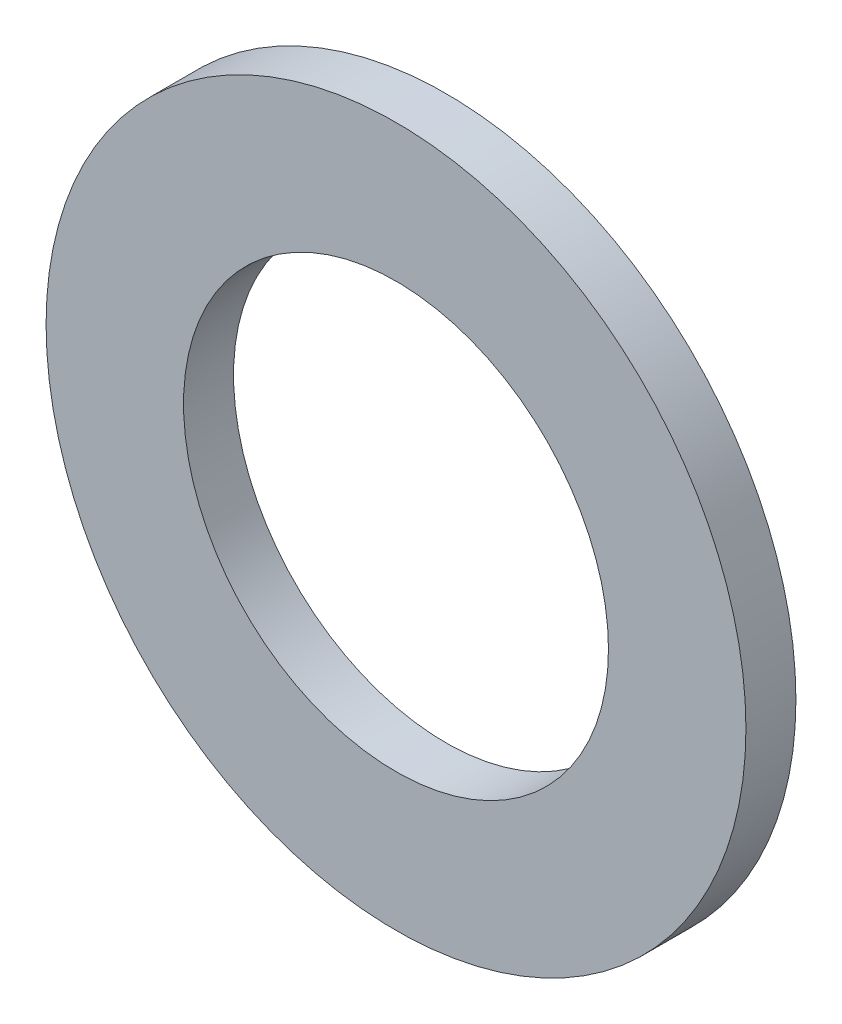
ISO-10303-21;
HEADER;
FILE_DESCRIPTION(('STEP AP214'),'2;1');
FILE_NAME('part.step','',(''),(''),'','','');
FILE_SCHEMA(('AUTOMOTIVE_DESIGN { 1 0 10303 214 1 1 1 1 }'));
ENDSEC;
DATA;
#1=APPLICATION_CONTEXT('core data for automotive mechanical design processes');
#2=APPLICATION_PROTOCOL_DEFINITION('international standard','automotive_design',2000,#1);
#3=PRODUCT_CONTEXT('',#1,'mechanical');
#4=PRODUCT('Part','Part','',(#3));
#5=PRODUCT_RELATED_PRODUCT_CATEGORY('part','',(#4));
#6=PRODUCT_DEFINITION_FORMATION('','',#4);
#7=PRODUCT_DEFINITION_CONTEXT('part definition',#1,'design');
#8=PRODUCT_DEFINITION('design','',#6,#7);
#9=PRODUCT_DEFINITION_SHAPE('','',#8);
#10=(LENGTH_UNIT() NAMED_UNIT(*) SI_UNIT(.MILLI.,.METRE.));
#11=(NAMED_UNIT(*) PLANE_ANGLE_UNIT() SI_UNIT($,.RADIAN.));
#12=(NAMED_UNIT(*) SI_UNIT($,.STERADIAN.) SOLID_ANGLE_UNIT());
#13=UNCERTAINTY_MEASURE_WITH_UNIT(LENGTH_MEASURE(1.E-05),#10,'distance_accuracy_value','');
#14=(GEOMETRIC_REPRESENTATION_CONTEXT(3) GLOBAL_UNCERTAINTY_ASSIGNED_CONTEXT((#13)) GLOBAL_UNIT_ASSIGNED_CONTEXT((#10,
#11,#12)) REPRESENTATION_CONTEXT('',''));
#15=CARTESIAN_POINT('',(0.,0.,0.));
#16=DIRECTION('',(0.,0.,1.));
#17=DIRECTION('',(1.,0.,0.));
#18=AXIS2_PLACEMENT_3D('',#15,#16,#17);
#19=CARTESIAN_POINT('',(0.,0.,0.999999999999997));
#20=DIRECTION('',(0.,0.,1.));
#21=DIRECTION('',(1.,0.,0.));
#22=AXIS2_PLACEMENT_3D('',#19,#20,#21);
#23=PLANE('',#22);
#24=CARTESIAN_POINT('',(0.,0.,0.999999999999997));
#25=DIRECTION('',(0.,0.,1.));
#26=DIRECTION('',(1.,0.,0.));
#27=AXIS2_PLACEMENT_3D('',#24,#25,#26);
#28=CIRCLE('',#27,7.);
#29=CARTESIAN_POINT('',(7.,0.,0.999999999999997));
#30=VERTEX_POINT('',#29);
#31=EDGE_CURVE('E10',#30,#30,#28,.T.);
#32=ORIENTED_EDGE('',*,*,#31,.T.);
#33=EDGE_LOOP('',(#32));
#34=FACE_BOUND('',#33,.T.);
#35=CARTESIAN_POINT('',(0.,0.,0.999999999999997));
#36=DIRECTION('',(0.,0.,1.));
#37=DIRECTION('',(1.,0.,0.));
#38=AXIS2_PLACEMENT_3D('',#35,#36,#37);
#39=CIRCLE('',#38,4.25);
#40=CARTESIAN_POINT('',(4.25,0.,0.999999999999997));
#41=VERTEX_POINT('',#40);
#42=EDGE_CURVE('E33',#41,#41,#39,.T.);
#43=ORIENTED_EDGE('',*,*,#42,.F.);
#44=EDGE_LOOP('',(#43));
#45=FACE_BOUND('',#44,.T.);
#46=ADVANCED_FACE('F22',(#34,#45),#23,.T.);
#47=CARTESIAN_POINT('',(0.,0.,0.));
#48=DIRECTION('',(0.,0.,1.));
#49=DIRECTION('',(1.,0.,0.));
#50=AXIS2_PLACEMENT_3D('',#47,#48,#49);
#51=PLANE('',#50);
#52=CARTESIAN_POINT('',(0.,0.,0.));
#53=DIRECTION('',(0.,0.,1.));
#54=DIRECTION('',(1.,0.,0.));
#55=AXIS2_PLACEMENT_3D('',#52,#53,#54);
#56=CIRCLE('',#55,7.);
#57=CARTESIAN_POINT('',(7.,0.,0.));
#58=VERTEX_POINT('',#57);
#59=EDGE_CURVE('E29',#58,#58,#56,.T.);
#60=ORIENTED_EDGE('',*,*,#59,.F.);
#61=EDGE_LOOP('',(#60));
#62=FACE_BOUND('',#61,.T.);
#63=CARTESIAN_POINT('',(0.,0.,0.));
#64=DIRECTION('',(0.,0.,1.));
#65=DIRECTION('',(1.,0.,0.));
#66=AXIS2_PLACEMENT_3D('',#63,#64,#65);
#67=CIRCLE('',#66,4.25);
#68=CARTESIAN_POINT('',(4.25,0.,0.));
#69=VERTEX_POINT('',#68);
#70=EDGE_CURVE('E37',#69,#69,#67,.T.);
#71=ORIENTED_EDGE('',*,*,#70,.T.);
#72=EDGE_LOOP('',(#71));
#73=FACE_BOUND('',#72,.T.);
#74=ADVANCED_FACE('F43',(#62,#73),#51,.F.);
#75=CARTESIAN_POINT('',(0.,0.,0.999999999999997));
#76=DIRECTION('',(0.,0.,-1.));
#77=DIRECTION('',(-1.,0.,0.));
#78=AXIS2_PLACEMENT_3D('',#75,#76,#77);
#79=CYLINDRICAL_SURFACE('',#78,7.);
#80=ORIENTED_EDGE('',*,*,#31,.F.);
#81=EDGE_LOOP('',(#80));
#82=FACE_BOUND('',#81,.T.);
#83=ORIENTED_EDGE('',*,*,#59,.T.);
#84=EDGE_LOOP('',(#83));
#85=FACE_BOUND('',#84,.T.);
#86=ADVANCED_FACE('F24',(#82,#85),#79,.T.);
#87=CARTESIAN_POINT('',(0.,0.,0.999999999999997));
#88=DIRECTION('',(0.,0.,-1.));
#89=DIRECTION('',(-1.,0.,0.));
#90=AXIS2_PLACEMENT_3D('',#87,#88,#89);
#91=CYLINDRICAL_SURFACE('',#90,4.25);
#92=ORIENTED_EDGE('',*,*,#42,.T.);
#93=EDGE_LOOP('',(#92));
#94=FACE_BOUND('',#93,.T.);
#95=ORIENTED_EDGE('',*,*,#70,.F.);
#96=EDGE_LOOP('',(#95));
#97=FACE_BOUND('',#96,.T.);
#98=ADVANCED_FACE('F45',(#94,#97),#91,.F.);
#99=CLOSED_SHELL('',(#46,#74,#86,#98));
#100=MANIFOLD_SOLID_BREP('B2',#99);
#101=ADVANCED_BREP_SHAPE_REPRESENTATION('',(#18,#100),#14);
#102=SHAPE_DEFINITION_REPRESENTATION(#9,#101);
ENDSEC;
END-ISO-10303-21;
